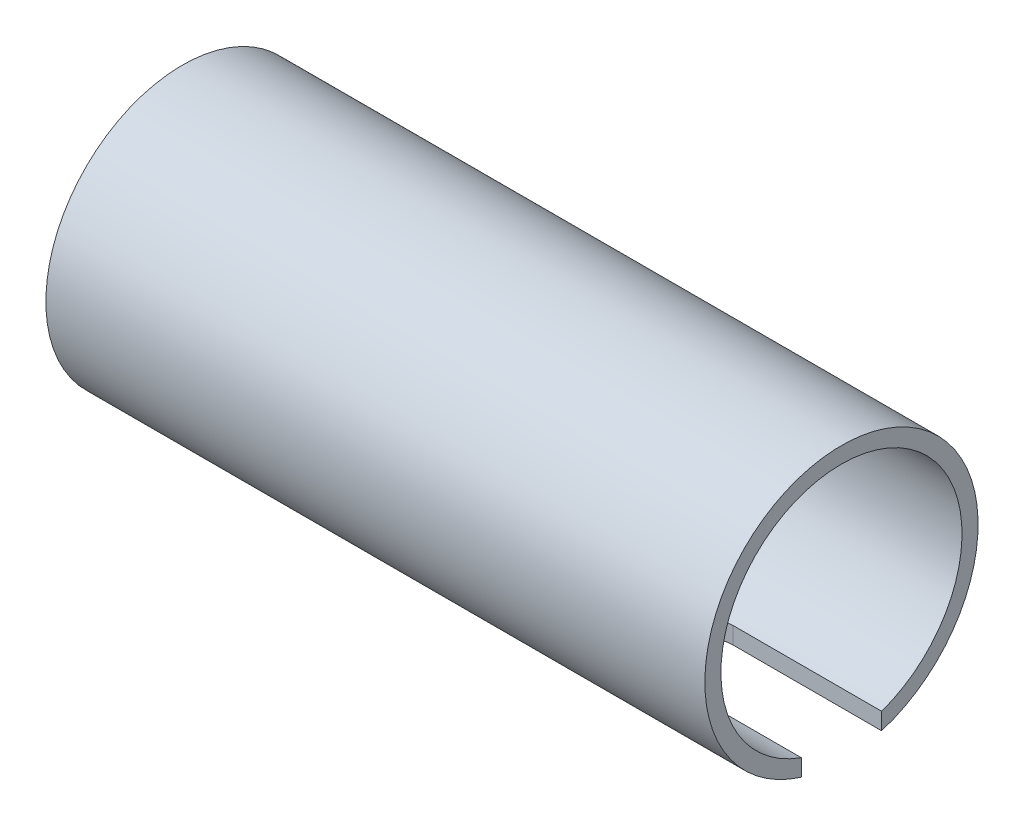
ISO-10303-21;
HEADER;
FILE_DESCRIPTION(('STEP AP214'),'2;1');
FILE_NAME('part.step','',(''),(''),'','','');
FILE_SCHEMA(('AUTOMOTIVE_DESIGN { 1 0 10303 214 1 1 1 1 }'));
ENDSEC;
DATA;
#1=APPLICATION_CONTEXT('core data for automotive mechanical design processes');
#2=APPLICATION_PROTOCOL_DEFINITION('international standard','automotive_design',2000,#1);
#3=PRODUCT_CONTEXT('',#1,'mechanical');
#4=PRODUCT('Part','Part','',(#3));
#5=PRODUCT_RELATED_PRODUCT_CATEGORY('part','',(#4));
#6=PRODUCT_DEFINITION_FORMATION('','',#4);
#7=PRODUCT_DEFINITION_CONTEXT('part definition',#1,'design');
#8=PRODUCT_DEFINITION('design','',#6,#7);
#9=PRODUCT_DEFINITION_SHAPE('','',#8);
#10=(LENGTH_UNIT() NAMED_UNIT(*) SI_UNIT(.MILLI.,.METRE.));
#11=(NAMED_UNIT(*) PLANE_ANGLE_UNIT() SI_UNIT($,.RADIAN.));
#12=(NAMED_UNIT(*) SI_UNIT($,.STERADIAN.) SOLID_ANGLE_UNIT());
#13=UNCERTAINTY_MEASURE_WITH_UNIT(LENGTH_MEASURE(1.E-05),#10,'distance_accuracy_value','');
#14=(GEOMETRIC_REPRESENTATION_CONTEXT(3) GLOBAL_UNCERTAINTY_ASSIGNED_CONTEXT((#13)) GLOBAL_UNIT_ASSIGNED_CONTEXT((#10,
#11,#12)) REPRESENTATION_CONTEXT('',''));
#15=CARTESIAN_POINT('',(0.,0.,0.));
#16=DIRECTION('',(0.,0.,1.));
#17=DIRECTION('',(1.,0.,0.));
#18=AXIS2_PLACEMENT_3D('',#15,#16,#17);
#19=CARTESIAN_POINT('',(41.,0.,0.));
#20=DIRECTION('',(1.,0.,0.));
#21=DIRECTION('',(0.,0.,-1.));
#22=AXIS2_PLACEMENT_3D('',#19,#20,#21);
#23=PLANE('',#22);
#24=DIRECTION('',(0.,-1.,0.));
#25=VECTOR('',#24,1.);
#26=CARTESIAN_POINT('',(41.,0.,2.5));
#27=LINE('',#26,#25);
#28=CARTESIAN_POINT('',(41.,-7.07106781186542,2.5));
#29=VERTEX_POINT('',#28);
#30=CARTESIAN_POINT('',(41.,-8.12403840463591,2.5));
#31=VERTEX_POINT('',#30);
#32=EDGE_CURVE('E57',#29,#31,#27,.T.);
#33=ORIENTED_EDGE('',*,*,#32,.F.);
#34=CARTESIAN_POINT('',(41.,0.,0.));
#35=DIRECTION('',(1.,0.,0.));
#36=DIRECTION('',(0.,0.,-1.));
#37=AXIS2_PLACEMENT_3D('',#34,#35,#36);
#38=CIRCLE('',#37,7.49999999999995);
#39=CARTESIAN_POINT('',(41.,-7.07106781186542,-2.5));
#40=VERTEX_POINT('',#39);
#41=EDGE_CURVE('E137',#40,#29,#38,.T.);
#42=ORIENTED_EDGE('',*,*,#41,.F.);
#43=DIRECTION('',(0.,1.,0.));
#44=VECTOR('',#43,1.);
#45=CARTESIAN_POINT('',(41.,0.,-2.5));
#46=LINE('',#45,#44);
#47=CARTESIAN_POINT('',(41.,-8.12403840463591,-2.5));
#48=VERTEX_POINT('',#47);
#49=EDGE_CURVE('E50',#48,#40,#46,.T.);
#50=ORIENTED_EDGE('',*,*,#49,.F.);
#51=CARTESIAN_POINT('',(41.,0.,0.));
#52=DIRECTION('',(1.,0.,0.));
#53=DIRECTION('',(0.,0.,-1.));
#54=AXIS2_PLACEMENT_3D('',#51,#52,#53);
#55=CIRCLE('',#54,8.49999999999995);
#56=EDGE_CURVE('E93',#48,#31,#55,.T.);
#57=ORIENTED_EDGE('',*,*,#56,.T.);
#58=EDGE_LOOP('',(#33,#42,#50,#57));
#59=FACE_BOUND('',#58,.T.);
#60=ADVANCED_FACE('F34',(#59),#23,.T.);
#61=CARTESIAN_POINT('',(0.,0.,0.));
#62=DIRECTION('',(1.,0.,0.));
#63=DIRECTION('',(0.,0.,-1.));
#64=AXIS2_PLACEMENT_3D('',#61,#62,#63);
#65=PLANE('',#64);
#66=CARTESIAN_POINT('',(0.,0.,0.));
#67=DIRECTION('',(1.,0.,0.));
#68=DIRECTION('',(0.,0.,-1.));
#69=AXIS2_PLACEMENT_3D('',#66,#67,#68);
#70=CIRCLE('',#69,8.49999999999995);
#71=CARTESIAN_POINT('',(0.,0.,-8.49999999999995));
#72=VERTEX_POINT('',#71);
#73=EDGE_CURVE('E132',#72,#72,#70,.T.);
#74=ORIENTED_EDGE('',*,*,#73,.F.);
#75=EDGE_LOOP('',(#74));
#76=FACE_BOUND('',#75,.T.);
#77=CARTESIAN_POINT('',(0.,0.,0.));
#78=DIRECTION('',(1.,0.,0.));
#79=DIRECTION('',(0.,0.,-1.));
#80=AXIS2_PLACEMENT_3D('',#77,#78,#79);
#81=CIRCLE('',#80,7.49999999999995);
#82=CARTESIAN_POINT('',(0.,0.,-7.49999999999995));
#83=VERTEX_POINT('',#82);
#84=EDGE_CURVE('E135',#83,#83,#81,.T.);
#85=ORIENTED_EDGE('',*,*,#84,.T.);
#86=EDGE_LOOP('',(#85));
#87=FACE_BOUND('',#86,.T.);
#88=ADVANCED_FACE('F122',(#76,#87),#65,.F.);
#89=CARTESIAN_POINT('',(41.,0.,0.));
#90=DIRECTION('',(-1.,0.,0.));
#91=DIRECTION('',(0.,0.,1.));
#92=AXIS2_PLACEMENT_3D('',#89,#90,#91);
#93=CYLINDRICAL_SURFACE('',#92,8.49999999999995);
#94=CARTESIAN_POINT('',(31.7450715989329,-8.12403840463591,-2.5));
#95=CARTESIAN_POINT('',(31.6763917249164,-8.12402906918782,-2.50000849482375));
#96=CARTESIAN_POINT('',(31.6077172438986,-8.12490911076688,-2.49717000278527));
#97=CARTESIAN_POINT('',(31.4708910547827,-8.1283785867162,-2.48586511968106));
#98=CARTESIAN_POINT('',(31.4027392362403,-8.13096764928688,-2.47739995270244));
#99=CARTESIAN_POINT('',(31.2676064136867,-8.13777747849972,-2.45493539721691));
#100=CARTESIAN_POINT('',(31.200622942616,-8.14199421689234,-2.44094966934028));
#101=CARTESIAN_POINT('',(31.0681454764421,-8.15192355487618,-2.40758038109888));
#102=CARTESIAN_POINT('',(31.002651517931,-8.15763619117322,-2.38819668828));
#103=CARTESIAN_POINT('',(30.8091249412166,-8.17677139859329,-2.32218333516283));
#104=CARTESIAN_POINT('',(30.6838804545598,-8.1922003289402,-2.26766331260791));
#105=CARTESIAN_POINT('',(30.444319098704,-8.22665400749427,-2.13928827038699));
#106=CARTESIAN_POINT('',(30.3300070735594,-8.24568033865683,-2.06542473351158));
#107=CARTESIAN_POINT('',(30.1120488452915,-8.28582980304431,-1.89805567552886));
#108=CARTESIAN_POINT('',(30.0087801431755,-8.30699606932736,-1.80406793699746));
#109=CARTESIAN_POINT('',(29.8192203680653,-8.34867230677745,-1.60015164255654));
#110=CARTESIAN_POINT('',(29.7329321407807,-8.36918216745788,-1.49022042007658));
#111=CARTESIAN_POINT('',(29.5781417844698,-8.40772509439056,-1.25484557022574));
#112=CARTESIAN_POINT('',(29.5100257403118,-8.42570106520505,-1.12913784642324));
#113=CARTESIAN_POINT('',(29.3960496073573,-8.45664705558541,-0.867439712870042));
#114=CARTESIAN_POINT('',(29.3501839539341,-8.46961832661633,-0.731451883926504));
#115=CARTESIAN_POINT('',(29.283259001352,-8.4887877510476,-0.457025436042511));
#116=CARTESIAN_POINT('',(29.2615510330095,-8.49516267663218,-0.318757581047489));
#117=CARTESIAN_POINT('',(29.2415084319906,-8.50104290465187,-0.0404023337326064));
#118=CARTESIAN_POINT('',(29.2431695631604,-8.50054945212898,0.0996847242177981));
#119=CARTESIAN_POINT('',(29.2693795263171,-8.49287404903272,0.373152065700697));
#120=CARTESIAN_POINT('',(29.2932257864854,-8.48589741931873,0.506606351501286));
#121=CARTESIAN_POINT('',(29.3619834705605,-8.46628787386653,0.767526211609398));
#122=CARTESIAN_POINT('',(29.4068959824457,-8.45365466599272,0.894991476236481));
#123=CARTESIAN_POINT('',(29.5169987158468,-8.42386367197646,1.14201050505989));
#124=CARTESIAN_POINT('',(29.5824136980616,-8.40665607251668,1.26145783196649));
#125=CARTESIAN_POINT('',(29.7314871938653,-8.369547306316,1.48790576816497));
#126=CARTESIAN_POINT('',(29.815149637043,-8.34964555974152,1.59490368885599));
#127=CARTESIAN_POINT('',(30.0019924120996,-8.30841337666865,1.79760092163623));
#128=CARTESIAN_POINT('',(30.1057805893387,-8.28705732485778,1.89273539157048));
#129=CARTESIAN_POINT('',(30.3280756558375,-8.24596689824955,2.06442395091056));
#130=CARTESIAN_POINT('',(30.4465867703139,-8.22623299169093,2.14097268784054));
#131=CARTESIAN_POINT('',(30.6964233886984,-8.19049726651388,2.27388499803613));
#132=CARTESIAN_POINT('',(30.8278590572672,-8.17453234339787,2.33005169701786));
#133=CARTESIAN_POINT('',(31.0988288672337,-8.14859211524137,2.41922275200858));
#134=CARTESIAN_POINT('',(31.2383503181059,-8.13860768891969,2.45226239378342));
#135=CARTESIAN_POINT('',(31.4401491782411,-8.12953164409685,2.48209216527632));
#136=CARTESIAN_POINT('',(31.5009669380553,-8.12747604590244,2.48880708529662));
#137=CARTESIAN_POINT('',(31.6228701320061,-8.1247293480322,2.49775684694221));
#138=CARTESIAN_POINT('',(31.6839550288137,-8.12403620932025,2.49999838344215));
#139=CARTESIAN_POINT('',(31.7450715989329,-8.12403840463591,2.5));
#140=B_SPLINE_CURVE_WITH_KNOTS('',3,(#94,#95,#96,#97,#98,#99,#100,#101,#102,#103,#104,#105,#106,
#107,#108,#109,#110,#111,#112,#113,#114,#115,#116,#117,#118,#119,#120,#121,#122,#123,#124,#125,
#126,#127,#128,#129,#130,#131,#132,#133,#134,#135,#136,#137,#138,#139),.UNSPECIFIED.,.F.,.F.,(4,
2,2,2,2,2,2,2,2,2,2,2,2,2,2,2,2,2,2,2,2,2,4),(0.,0.205966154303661,0.411887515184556,
0.617302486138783,0.822722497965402,1.23305966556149,1.64357781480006,2.0653304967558,
2.48715379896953,2.91733102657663,3.3474006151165,3.76562050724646,4.18376458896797,
4.58910158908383,4.9944595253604,5.40442657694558,5.81448200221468,6.23971616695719,
6.66507264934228,7.09443475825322,7.52314033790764,7.70665727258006,7.88989934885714),.UNSPECIFIED.);
#141=CARTESIAN_POINT('',(31.7450715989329,-8.12403840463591,-2.5));
#142=VERTEX_POINT('',#141);
#143=CARTESIAN_POINT('',(31.7450715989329,-8.12403840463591,2.5));
#144=VERTEX_POINT('',#143);
#145=EDGE_CURVE('E76',#142,#144,#140,.T.);
#146=ORIENTED_EDGE('',*,*,#145,.T.);
#147=DIRECTION('',(-1.,0.,0.));
#148=VECTOR('',#147,1.);
#149=CARTESIAN_POINT('',(41.,-8.12403840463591,2.5));
#150=LINE('',#149,#148);
#151=EDGE_CURVE('E138',#144,#31,#150,.F.);
#152=ORIENTED_EDGE('',*,*,#151,.T.);
#153=ORIENTED_EDGE('',*,*,#56,.F.);
#154=DIRECTION('',(-1.,0.,0.));
#155=VECTOR('',#154,1.);
#156=CARTESIAN_POINT('',(41.,-8.12403840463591,-2.5));
#157=LINE('',#156,#155);
#158=EDGE_CURVE('E85',#48,#142,#157,.T.);
#159=ORIENTED_EDGE('',*,*,#158,.T.);
#160=EDGE_LOOP('',(#146,#152,#153,#159));
#161=FACE_BOUND('',#160,.T.);
#162=ORIENTED_EDGE('',*,*,#73,.T.);
#163=EDGE_LOOP('',(#162));
#164=FACE_BOUND('',#163,.T.);
#165=ADVANCED_FACE('F36',(#161,#164),#93,.T.);
#166=CARTESIAN_POINT('',(41.,0.,0.));
#167=DIRECTION('',(-1.,0.,0.));
#168=DIRECTION('',(0.,0.,1.));
#169=AXIS2_PLACEMENT_3D('',#166,#167,#168);
#170=CYLINDRICAL_SURFACE('',#169,7.49999999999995);
#171=DIRECTION('',(-1.,0.,0.));
#172=VECTOR('',#171,1.);
#173=CARTESIAN_POINT('',(41.,-7.07106781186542,2.5));
#174=LINE('',#173,#172);
#175=CARTESIAN_POINT('',(31.7450715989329,-7.07106781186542,2.5));
#176=VERTEX_POINT('',#175);
#177=EDGE_CURVE('E11',#176,#29,#174,.F.);
#178=ORIENTED_EDGE('',*,*,#177,.F.);
#179=CARTESIAN_POINT('',(31.7450715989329,-7.07106781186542,-2.5));
#180=CARTESIAN_POINT('',(31.6768645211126,-7.07105693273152,-2.50000899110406));
#181=CARTESIAN_POINT('',(31.6086635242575,-7.07205443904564,-2.49720887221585));
#182=CARTESIAN_POINT('',(31.4727905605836,-7.07598524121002,-2.4860604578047));
#183=CARTESIAN_POINT('',(31.4051184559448,-7.07891801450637,-2.47771365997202));
#184=CARTESIAN_POINT('',(31.2709811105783,-7.08662705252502,-2.45557459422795));
#185=CARTESIAN_POINT('',(31.204512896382,-7.09139784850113,-2.44179847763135));
#186=CARTESIAN_POINT('',(31.0730633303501,-7.10262619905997,-2.4089418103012));
#187=CARTESIAN_POINT('',(31.008082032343,-7.10908381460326,-2.38986106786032));
#188=CARTESIAN_POINT('',(30.8161100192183,-7.13069940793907,-2.32491551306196));
#189=CARTESIAN_POINT('',(30.6918924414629,-7.14811243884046,-2.2713141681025));
#190=CARTESIAN_POINT('',(30.4541947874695,-7.18697034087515,-2.14517784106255));
#191=CARTESIAN_POINT('',(30.3407213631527,-7.20841768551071,-2.07263123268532));
#192=CARTESIAN_POINT('',(30.1232786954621,-7.25386182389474,-1.90762995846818));
#193=CARTESIAN_POINT('',(30.0197864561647,-7.27792189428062,-1.81456284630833));
#194=CARTESIAN_POINT('',(29.8295544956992,-7.32534626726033,-1.61247071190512));
#195=CARTESIAN_POINT('',(29.7428177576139,-7.34871044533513,-1.50344285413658));
#196=CARTESIAN_POINT('',(29.5863733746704,-7.39284706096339,-1.26900922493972));
#197=CARTESIAN_POINT('',(29.5171692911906,-7.41353593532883,-1.14325025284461));
#198=CARTESIAN_POINT('',(29.4010908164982,-7.44924021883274,-0.88107309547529));
#199=CARTESIAN_POINT('',(29.3542096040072,-7.46425736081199,-0.744658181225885));
#200=CARTESIAN_POINT('',(29.2857323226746,-7.48647677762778,-0.47007337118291));
#201=CARTESIAN_POINT('',(29.2633134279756,-7.49393272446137,-0.332129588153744));
#202=CARTESIAN_POINT('',(29.2417808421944,-7.50109021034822,-0.0542474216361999));
#203=CARTESIAN_POINT('',(29.2426615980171,-7.500793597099,0.085690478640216));
#204=CARTESIAN_POINT('',(29.2671823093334,-7.49265096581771,0.357759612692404));
#205=CARTESIAN_POINT('',(29.2899281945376,-7.48510152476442,0.489981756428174));
#206=CARTESIAN_POINT('',(29.3560545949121,-7.46367401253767,0.748610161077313));
#207=CARTESIAN_POINT('',(29.3994362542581,-7.44979559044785,0.875016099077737));
#208=CARTESIAN_POINT('',(29.5061250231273,-7.41689170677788,1.12038155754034));
#209=CARTESIAN_POINT('',(29.5696867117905,-7.39780094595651,1.23922126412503));
#210=CARTESIAN_POINT('',(29.7147214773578,-7.35645969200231,1.46481147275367));
#211=CARTESIAN_POINT('',(29.796199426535,-7.33420833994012,1.57155867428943));
#212=CARTESIAN_POINT('',(29.9792492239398,-7.28765679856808,1.77524334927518));
#213=CARTESIAN_POINT('',(30.0815854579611,-7.26330946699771,1.87148402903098));
#214=CARTESIAN_POINT('',(30.3011753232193,-7.21618726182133,2.04568006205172));
#215=CARTESIAN_POINT('',(30.4184337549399,-7.19341289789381,2.12362950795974));
#216=CARTESIAN_POINT('',(30.6667720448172,-7.15175078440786,2.26000831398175));
#217=CARTESIAN_POINT('',(30.7980303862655,-7.13292537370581,2.31813252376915));
#218=CARTESIAN_POINT('',(31.0691890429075,-7.10202742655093,2.41115057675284));
#219=CARTESIAN_POINT('',(31.2090753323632,-7.08994423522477,2.4460810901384));
#220=CARTESIAN_POINT('',(31.4161181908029,-7.07841355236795,2.47914539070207));
#221=CARTESIAN_POINT('',(31.4816750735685,-7.07566669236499,2.48696265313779));
#222=CARTESIAN_POINT('',(31.6131667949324,-7.07199258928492,2.497386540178));
#223=CARTESIAN_POINT('',(31.6791010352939,-7.07106299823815,2.49999988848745));
#224=CARTESIAN_POINT('',(31.7450715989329,-7.07106781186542,2.5));
#225=B_SPLINE_CURVE_WITH_KNOTS('',3,(#179,#180,#181,#182,#183,#184,#185,#186,#187,#188,#189,
#190,#191,#192,#193,#194,#195,#196,#197,#198,#199,#200,#201,#202,#203,#204,#205,#206,#207,#208,
#209,#210,#211,#212,#213,#214,#215,#216,#217,#218,#219,#220,#221,#222,#223,#224),.UNSPECIFIED.,
.F.,.F.,(4,2,2,2,2,2,2,2,2,2,2,2,2,2,2,2,2,2,2,2,2,2,4),(0.,0.20454621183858,0.409037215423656,
0.612924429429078,0.816819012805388,1.22401016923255,1.63145179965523,2.0532786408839,
2.47518051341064,2.90809434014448,3.34087579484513,3.75860278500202,4.17623021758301,
4.57747647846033,4.97874498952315,5.38529148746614,5.79194868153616,6.21771736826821,
6.64362337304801,7.07581676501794,7.50732520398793,7.70536340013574,7.90314555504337),.UNSPECIFIED.);
#226=CARTESIAN_POINT('',(31.7450715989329,-7.07106781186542,-2.5));
#227=VERTEX_POINT('',#226);
#228=EDGE_CURVE('E43',#227,#176,#225,.T.);
#229=ORIENTED_EDGE('',*,*,#228,.F.);
#230=DIRECTION('',(-1.,0.,0.));
#231=VECTOR('',#230,1.);
#232=CARTESIAN_POINT('',(41.,-7.07106781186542,-2.5));
#233=LINE('',#232,#231);
#234=EDGE_CURVE('E88',#40,#227,#233,.T.);
#235=ORIENTED_EDGE('',*,*,#234,.F.);
#236=ORIENTED_EDGE('',*,*,#41,.T.);
#237=EDGE_LOOP('',(#178,#229,#235,#236));
#238=FACE_BOUND('',#237,.T.);
#239=ORIENTED_EDGE('',*,*,#84,.F.);
#240=EDGE_LOOP('',(#239));
#241=FACE_BOUND('',#240,.T.);
#242=ADVANCED_FACE('F116',(#238,#241),#170,.F.);
#243=CARTESIAN_POINT('',(46.0293517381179,-10.,2.5));
#244=DIRECTION('',(0.,0.,1.));
#245=DIRECTION('',(1.,0.,0.));
#246=AXIS2_PLACEMENT_3D('',#243,#244,#245);
#247=PLANE('',#246);
#248=DIRECTION('',(0.,1.,0.));
#249=VECTOR('',#248,1.);
#250=CARTESIAN_POINT('',(31.7450715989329,-10.,2.5));
#251=LINE('',#250,#249);
#252=EDGE_CURVE('E82',#144,#176,#251,.T.);
#253=ORIENTED_EDGE('',*,*,#252,.T.);
#254=ORIENTED_EDGE('',*,*,#177,.T.);
#255=ORIENTED_EDGE('',*,*,#32,.T.);
#256=ORIENTED_EDGE('',*,*,#151,.F.);
#257=EDGE_LOOP('',(#253,#254,#255,#256));
#258=FACE_BOUND('',#257,.T.);
#259=ADVANCED_FACE('F107',(#258),#247,.F.);
#260=CARTESIAN_POINT('',(31.7450715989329,-10.,0.));
#261=DIRECTION('',(0.,1.,0.));
#262=DIRECTION('',(0.,0.,1.));
#263=AXIS2_PLACEMENT_3D('',#260,#261,#262);
#264=CYLINDRICAL_SURFACE('',#263,2.5);
#265=DIRECTION('',(0.,1.,0.));
#266=VECTOR('',#265,1.);
#267=CARTESIAN_POINT('',(31.7450715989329,-10.,-2.5));
#268=LINE('',#267,#266);
#269=EDGE_CURVE('E79',#142,#227,#268,.T.);
#270=ORIENTED_EDGE('',*,*,#269,.T.);
#271=ORIENTED_EDGE('',*,*,#228,.T.);
#272=ORIENTED_EDGE('',*,*,#252,.F.);
#273=ORIENTED_EDGE('',*,*,#145,.F.);
#274=EDGE_LOOP('',(#270,#271,#272,#273));
#275=FACE_BOUND('',#274,.T.);
#276=ADVANCED_FACE('F78',(#275),#264,.F.);
#277=CARTESIAN_POINT('',(46.0293517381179,-10.,-2.5));
#278=DIRECTION('',(0.,0.,-1.));
#279=DIRECTION('',(-1.,0.,0.));
#280=AXIS2_PLACEMENT_3D('',#277,#278,#279);
#281=PLANE('',#280);
#282=ORIENTED_EDGE('',*,*,#49,.T.);
#283=ORIENTED_EDGE('',*,*,#234,.T.);
#284=ORIENTED_EDGE('',*,*,#269,.F.);
#285=ORIENTED_EDGE('',*,*,#158,.F.);
#286=EDGE_LOOP('',(#282,#283,#284,#285));
#287=FACE_BOUND('',#286,.T.);
#288=ADVANCED_FACE('F87',(#287),#281,.F.);
#289=CLOSED_SHELL('',(#60,#88,#165,#242,#259,#276,#288));
#290=MANIFOLD_SOLID_BREP('B2',#289);
#291=ADVANCED_BREP_SHAPE_REPRESENTATION('',(#18,#290),#14);
#292=SHAPE_DEFINITION_REPRESENTATION(#9,#291);
ENDSEC;
END-ISO-10303-21;
